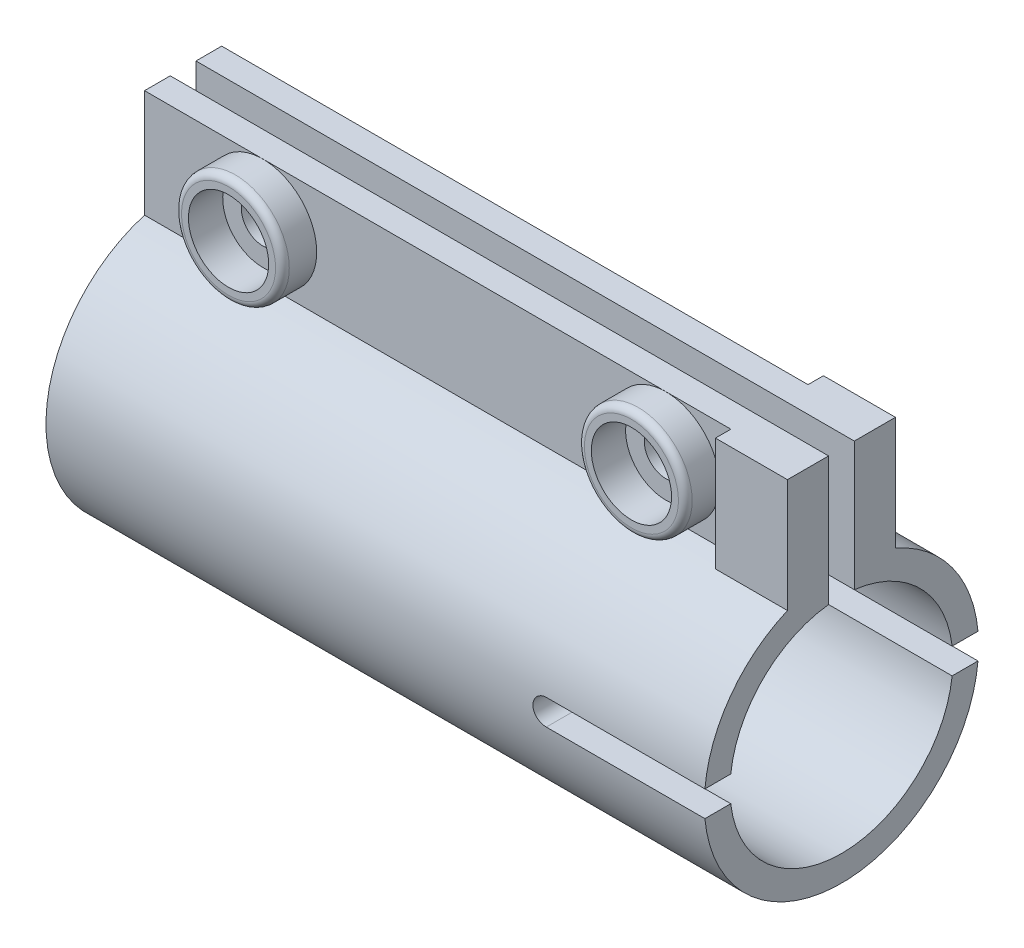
from build123d import *

# Parameters (mm, degrees)
SKETCH1_R               = 8.255
BASE_EXTRUDE_DEPTH      = 48.768
SHELL1_T                = 1.905
CUT_EXTRUDE1_DEPTH      = 51.840623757
CUT_EXTRUDE1_DEPTH_BACK = 51.840623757
SKETCH3_W               = 1.905
SKETCH3_H               = 10.16
CUT_EXTRUDE2_DEPTH      = 51.840623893
SKETCH4_W               = 1.905
SKETCH4_H               = 9.535389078
BOSS_EXTRUDE2_DEPTH     = 48.768
SKETCH6_W               = 1.143
SKETCH6_H               = 8.396002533
BOSS_EXTRUDE4_DEPTH     = 5.334
CUT_EXTRUDE3_REACH      = 55.501
SKETCH7_R               = 1.5875
CUT_EXTRUDE4_REACH      = 55.501
SKETCH8_R               = 1.5875
SKETCH9_R               = 3.991513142
SKETCH9_R_2             = 2.9718
BOSS_EXTRUDE5_DEPTH     = 2.54
FILLET1_R               = 0.508


with BuildPart() as part:
    # Sketch1 → Base-Extrude (new body)
    with BuildSketch(Plane(origin=(0, 0, 0), x_dir=(0, 0, -1), z_dir=(1, 0, 0))):
        Circle(SKETCH1_R)
    extrude(amount=-BASE_EXTRUDE_DEPTH)

    # Shell1
    shell1_openings = [part.faces().sort_by_distance(p)[0] for p in [
        (0, 0, 0),
        (-48.768, 0, 0),
    ]]
    offset(amount=SHELL1_T, openings=shell1_openings, kind=Kind.INTERSECTION)

    # Sketch2 → Cut-Extrude1 (cut, two sides: drawn at the far end of the back side and taken through both)
    with BuildSketch(Plane.XY.offset(-CUT_EXTRUDE1_DEPTH_BACK)):
        with BuildLine():
            Line((0, 0.9525), (-11.7475, 0.9525))
            ThreePointArc((-11.7475, 0.9525), (-12.7, 0), (-11.7475, -0.9525))
            Line((-11.7475, -0.9525), (0, -0.9525))
            Line((0, -0.9525), (0, 0.9525))
        make_face()
    extrude(amount=CUT_EXTRUDE1_DEPTH + CUT_EXTRUDE1_DEPTH_BACK, mode=Mode.SUBTRACT)

    # Sketch3 → Cut-Extrude2 (cut, through all)
    with BuildSketch(Plane(origin=(0, 0, 0), x_dir=(0, 0, -1), z_dir=(1, 0, 0))):
        with Locations((0, 5.08)):
            Rectangle(SKETCH3_W, SKETCH3_H)
    extrude(amount=-CUT_EXTRUDE2_DEPTH, mode=Mode.SUBTRACT)

    # Sketch4 → Boss-Extrude2 (add, through all)
    with BuildSketch(Plane(origin=(0, 0, 0), x_dir=(0, 0, -1), z_dir=(1, 0, 0))):
        with Locations((-1.905, 12.967558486)):
            Rectangle(SKETCH4_W, SKETCH4_H)
        with Locations((1.905, 12.967558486)):
            Rectangle(SKETCH4_W, SKETCH4_H)
    extrude(amount=-BOSS_EXTRUDE2_DEPTH)

    # Sketch6 → Boss-Extrude4 (add)
    with BuildSketch(Plane(origin=(0, 0, 0), x_dir=(0, 0, -1), z_dir=(1, 0, 0))):
        with Locations((-3.429, 13.537251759)):
            Rectangle(SKETCH6_W, SKETCH6_H)
        with Locations((3.429, 13.537251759)):
            Rectangle(SKETCH6_W, SKETCH6_H)
    extrude(amount=-BOSS_EXTRUDE4_DEPTH)

    # Sketch7 → Cut-Extrude3 (cut, up to next)
    with BuildSketch(Plane.XY.offset(2.8575), mode=Mode.PRIVATE) as cut_extrude3_sk1:
        with Locations((-10.16, 13.7414)):
            Circle(SKETCH7_R)
    cut_extrude3_tool1 = extrude(cut_extrude3_sk1.sketch, amount=-CUT_EXTRUDE3_REACH, mode=Mode.PRIVATE) & part.part
    # Sketch7 → Cut-Extrude3 (cut, up to next)
    with BuildSketch(Plane.XY.offset(2.8575), mode=Mode.PRIVATE) as cut_extrude3_sk2:
        with Locations((-40.005, 13.7414)):
            Circle(SKETCH7_R)
    cut_extrude3_tool2 = extrude(cut_extrude3_sk2.sketch, amount=-CUT_EXTRUDE3_REACH, mode=Mode.PRIVATE) & part.part
    add(cut_extrude3_tool1.solids().sort_by_distance((-10.16, 13.7414, 2.8575))[0], mode=Mode.SUBTRACT)
    add(cut_extrude3_tool2.solids().sort_by_distance((-40.005, 13.7414, 2.8575))[0], mode=Mode.SUBTRACT)

    # Sketch8 → Cut-Extrude4 (cut, up to next)
    with BuildSketch(Plane(origin=(0, 0, -2.8575), x_dir=(-1, 0, 0), z_dir=(0, 0, -1)), mode=Mode.PRIVATE) as cut_extrude4_sk1:
        with Locations(Location((40.005, 13.7414, 0), (0, 0, 180))):
            Circle(SKETCH8_R)
    cut_extrude4_tool1 = extrude(cut_extrude4_sk1.sketch, amount=-CUT_EXTRUDE4_REACH, mode=Mode.PRIVATE) & part.part
    # Sketch8 → Cut-Extrude4 (cut, up to next)
    with BuildSketch(Plane(origin=(0, 0, -2.8575), x_dir=(-1, 0, 0), z_dir=(0, 0, -1)), mode=Mode.PRIVATE) as cut_extrude4_sk2:
        with Locations(Location((10.16, 13.7414, 0), (0, 0, 180))):
            Circle(SKETCH8_R)
    cut_extrude4_tool2 = extrude(cut_extrude4_sk2.sketch, amount=-CUT_EXTRUDE4_REACH, mode=Mode.PRIVATE) & part.part
    add(cut_extrude4_tool1.solids().sort_by_distance((-40.005, 13.7414, -2.8575))[0], mode=Mode.SUBTRACT)
    add(cut_extrude4_tool2.solids().sort_by_distance((-10.16, 13.7414, -2.8575))[0], mode=Mode.SUBTRACT)

    # Sketch9 → Boss-Extrude5 (add)
    # profile 1 of 2: a face of its own
    with BuildSketch(Plane.XY.offset(2.8575)):
        with Locations(Location((-40.005, 13.7414, 0), (0, 0, 270))):
            Circle(SKETCH9_R)
        with Locations(Location((-40.005, 13.7414, 0), (0, 0, 270))):
            Circle(SKETCH9_R_2, mode=Mode.SUBTRACT)
    # profile 2 of 2: a face of its own
    with BuildSketch(Plane.XY.offset(2.8575)):
        with Locations(Location((-10.16, 13.7414, 0), (0, 0, 270))):
            Circle(SKETCH9_R)
        with Locations(Location((-10.16, 13.7414, 0), (0, 0, 270))):
            Circle(SKETCH9_R_2, mode=Mode.SUBTRACT)
    extrude(amount=BOSS_EXTRUDE5_DEPTH)

    # Fillet1
    fillet1_edges = [part.edges().sort_by_distance(p)[0] for p in [
        (-40.005, 17.732913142, 5.3975),
        (-10.16, 17.732913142, 5.3975),
    ]]
    fillet(fillet1_edges, radius=FILLET1_R)


solid = part.part
